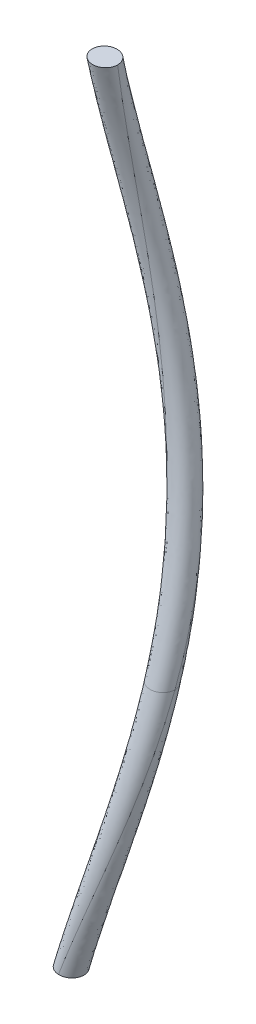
ISO-10303-21;
HEADER;
FILE_DESCRIPTION(('STEP AP214'),'2;1');
FILE_NAME('part.step','',(''),(''),'','','');
FILE_SCHEMA(('AUTOMOTIVE_DESIGN { 1 0 10303 214 1 1 1 1 }'));
ENDSEC;
DATA;
#1=APPLICATION_CONTEXT('core data for automotive mechanical design processes');
#2=APPLICATION_PROTOCOL_DEFINITION('international standard','automotive_design',2000,#1);
#3=PRODUCT_CONTEXT('',#1,'mechanical');
#4=PRODUCT('Part','Part','',(#3));
#5=PRODUCT_RELATED_PRODUCT_CATEGORY('part','',(#4));
#6=PRODUCT_DEFINITION_FORMATION('','',#4);
#7=PRODUCT_DEFINITION_CONTEXT('part definition',#1,'design');
#8=PRODUCT_DEFINITION('design','',#6,#7);
#9=PRODUCT_DEFINITION_SHAPE('','',#8);
#10=(LENGTH_UNIT() NAMED_UNIT(*) SI_UNIT(.MILLI.,.METRE.));
#11=(NAMED_UNIT(*) PLANE_ANGLE_UNIT() SI_UNIT($,.RADIAN.));
#12=(NAMED_UNIT(*) SI_UNIT($,.STERADIAN.) SOLID_ANGLE_UNIT());
#13=UNCERTAINTY_MEASURE_WITH_UNIT(LENGTH_MEASURE(1.E-05),#10,'distance_accuracy_value','');
#14=(GEOMETRIC_REPRESENTATION_CONTEXT(3) GLOBAL_UNCERTAINTY_ASSIGNED_CONTEXT((#13)) GLOBAL_UNIT_ASSIGNED_CONTEXT((#10,
#11,#12)) REPRESENTATION_CONTEXT('',''));
#15=CARTESIAN_POINT('',(0.,0.,0.));
#16=DIRECTION('',(0.,0.,1.));
#17=DIRECTION('',(1.,0.,0.));
#18=AXIS2_PLACEMENT_3D('',#15,#16,#17);
#19=CARTESIAN_POINT('',(-50.9866786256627,-23.4965384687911,-35.56104775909));
#20=DIRECTION('',(-0.0440198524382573,-0.999030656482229,0.));
#21=DIRECTION('',(0.999030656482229,-0.0440198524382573,0.));
#22=AXIS2_PLACEMENT_3D('',#19,#20,#21);
#23=PLANE('',#22);
#24=CARTESIAN_POINT('',(-50.9866786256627,-23.4965384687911,-34.49307437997));
#25=CARTESIAN_POINT('',(-50.9585774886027,-23.4977766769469,-34.4930982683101));
#26=CARTESIAN_POINT('',(-50.9304834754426,-23.4990145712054,-34.4907021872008));
#27=CARTESIAN_POINT('',(-50.8751101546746,-23.5014544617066,-34.4812461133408));
#28=CARTESIAN_POINT('',(-50.8478302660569,-23.5026564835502,-34.4741895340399));
#29=CARTESIAN_POINT('',(-50.7948299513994,-23.5049918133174,-34.4555837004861));
#30=CARTESIAN_POINT('',(-50.7691102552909,-23.5061250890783,-34.4440323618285));
#31=CARTESIAN_POINT('',(-50.7199779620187,-23.5082899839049,-34.4167752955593));
#32=CARTESIAN_POINT('',(-50.6965649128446,-23.5093216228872,-34.4010703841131));
#33=CARTESIAN_POINT('',(-50.6527183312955,-23.5112536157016,-34.3659595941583));
#34=CARTESIAN_POINT('',(-50.6322830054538,-23.5121540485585,-34.3465559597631));
#35=CARTESIAN_POINT('',(-50.5949277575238,-23.5138000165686,-34.3045623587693));
#36=CARTESIAN_POINT('',(-50.5780128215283,-23.5145453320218,-34.2819679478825));
#37=CARTESIAN_POINT('',(-50.5482386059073,-23.5158572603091,-34.2342926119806));
#38=CARTESIAN_POINT('',(-50.5353731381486,-23.5164241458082,-34.2092155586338));
#39=CARTESIAN_POINT('',(-50.5140091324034,-23.5173654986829,-34.157212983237));
#40=CARTESIAN_POINT('',(-50.5055179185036,-23.5177396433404,-34.130284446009));
#41=CARTESIAN_POINT('',(-50.4931765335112,-23.518283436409,-34.0753820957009));
#42=CARTESIAN_POINT('',(-50.4893263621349,-23.5184530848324,-34.0474082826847));
#43=CARTESIAN_POINT('',(-50.4863788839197,-23.5185829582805,-33.9912578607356));
#44=CARTESIAN_POINT('',(-50.487273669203,-23.5185435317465,-33.9630816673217));
#45=CARTESIAN_POINT('',(-50.4937774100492,-23.518256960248,-33.9072365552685));
#46=CARTESIAN_POINT('',(-50.4993934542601,-23.5180095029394,-33.8795684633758));
#47=CARTESIAN_POINT('',(-50.5151787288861,-23.5173139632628,-33.8256062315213));
#48=CARTESIAN_POINT('',(-50.5253418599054,-23.5168661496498,-33.7993103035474));
#49=CARTESIAN_POINT('',(-50.5499401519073,-23.5157822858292,-33.7487802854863));
#50=CARTESIAN_POINT('',(-50.5643782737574,-23.5151461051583,-33.7245476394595));
#51=CARTESIAN_POINT('',(-50.5971132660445,-23.5137037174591,-33.6788538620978));
#52=CARTESIAN_POINT('',(-50.6154099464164,-23.5128975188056,-33.6573925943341));
#53=CARTESIAN_POINT('',(-50.6553439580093,-23.511137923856,-33.6178482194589));
#54=CARTESIAN_POINT('',(-50.6769814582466,-23.5101845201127,-33.599765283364));
#55=CARTESIAN_POINT('',(-50.7229816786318,-23.5081576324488,-33.5674934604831));
#56=CARTESIAN_POINT('',(-50.7473442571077,-23.5070841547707,-33.5533043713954));
#57=CARTESIAN_POINT('',(-50.7981214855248,-23.5048467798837,-33.5292109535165));
#58=CARTESIAN_POINT('',(-50.824537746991,-23.5036828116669,-33.5193100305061));
#59=CARTESIAN_POINT('',(-50.8786231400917,-23.5012996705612,-33.5041071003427));
#60=CARTESIAN_POINT('',(-50.9062902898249,-23.5000805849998,-33.49879806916));
#61=CARTESIAN_POINT('',(-50.951629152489,-23.498082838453,-33.4939949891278));
#62=CARTESIAN_POINT('',(-50.9691584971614,-23.497310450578,-33.4930669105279));
#63=CARTESIAN_POINT('',(-50.9866786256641,-23.496538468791,-33.49307437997));
#64=B_SPLINE_CURVE_WITH_KNOTS('',3,(#24,#25,#26,#27,#28,#29,#30,#31,#32,#33,#34,#35,#36,#37,#38,
#39,#40,#41,#42,#43,#44,#45,#46,#47,#48,#49,#50,#51,#52,#53,#54,#55,#56,#57,#58,#59,#60,#61,#62,
#63),.UNSPECIFIED.,.F.,.F.,(4,2,2,2,2,2,2,2,2,2,2,2,2,2,2,2,2,2,2,4),(0.,0.0842731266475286,
0.168484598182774,0.252735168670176,0.336969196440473,0.421152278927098,0.505453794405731,
0.589625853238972,0.673938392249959,0.758250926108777,0.842422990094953,0.926721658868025,
1.0109075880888,1.09515196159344,1.17939218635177,1.26363667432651,1.34787678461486,
1.43218367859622,1.51636138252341,1.56897272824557),.UNSPECIFIED.);
#65=CARTESIAN_POINT('',(-50.9866786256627,-23.4965384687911,-34.49307437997));
#66=VERTEX_POINT('',#65);
#67=CARTESIAN_POINT('',(-50.9866786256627,-23.4965384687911,-33.49307437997));
#68=VERTEX_POINT('',#67);
#69=EDGE_CURVE('E21',#66,#68,#64,.T.);
#70=ORIENTED_EDGE('',*,*,#69,.T.);
#71=CARTESIAN_POINT('',(-50.9866786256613,-23.4965384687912,-33.49307437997));
#72=CARTESIAN_POINT('',(-51.0147797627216,-23.4953002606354,-33.4930504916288));
#73=CARTESIAN_POINT('',(-51.0428737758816,-23.4940623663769,-33.4954465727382));
#74=CARTESIAN_POINT('',(-51.0982470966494,-23.4916224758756,-33.5049026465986));
#75=CARTESIAN_POINT('',(-51.1255269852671,-23.4904204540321,-33.5119592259));
#76=CARTESIAN_POINT('',(-51.1785272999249,-23.4880851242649,-33.5305650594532));
#77=CARTESIAN_POINT('',(-51.204246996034,-23.4869518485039,-33.5421163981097));
#78=CARTESIAN_POINT('',(-51.2533792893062,-23.4847869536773,-33.5693734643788));
#79=CARTESIAN_POINT('',(-51.2767923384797,-23.483755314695,-33.585078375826));
#80=CARTESIAN_POINT('',(-51.3206389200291,-23.4818233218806,-33.6201891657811));
#81=CARTESIAN_POINT('',(-51.3410742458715,-23.4809228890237,-33.6395928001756));
#82=CARTESIAN_POINT('',(-51.3784294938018,-23.4792769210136,-33.6815864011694));
#83=CARTESIAN_POINT('',(-51.3953444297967,-23.4785316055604,-33.7041808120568));
#84=CARTESIAN_POINT('',(-51.4251186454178,-23.4772196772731,-33.751856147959));
#85=CARTESIAN_POINT('',(-51.4379841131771,-23.476652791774,-33.7769332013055));
#86=CARTESIAN_POINT('',(-51.4593481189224,-23.4757114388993,-33.8289357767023));
#87=CARTESIAN_POINT('',(-51.4678393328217,-23.4753372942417,-33.8558643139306));
#88=CARTESIAN_POINT('',(-51.480180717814,-23.4747935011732,-33.9107666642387));
#89=CARTESIAN_POINT('',(-51.4840308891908,-23.4746238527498,-33.9387404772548));
#90=CARTESIAN_POINT('',(-51.4869783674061,-23.4744939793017,-33.9948908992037));
#91=CARTESIAN_POINT('',(-51.4860835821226,-23.4745334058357,-34.0230670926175));
#92=CARTESIAN_POINT('',(-51.4795798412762,-23.4748199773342,-34.0789122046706));
#93=CARTESIAN_POINT('',(-51.4739637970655,-23.4750674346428,-34.1065802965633));
#94=CARTESIAN_POINT('',(-51.4581785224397,-23.4757629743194,-34.1605425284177));
#95=CARTESIAN_POINT('',(-51.4480153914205,-23.4762107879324,-34.1868384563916));
#96=CARTESIAN_POINT('',(-51.4234170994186,-23.4772946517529,-34.2373684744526));
#97=CARTESIAN_POINT('',(-51.4089789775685,-23.4779308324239,-34.2616011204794));
#98=CARTESIAN_POINT('',(-51.3762439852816,-23.4793732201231,-34.3072948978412));
#99=CARTESIAN_POINT('',(-51.35794730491,-23.4801794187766,-34.3287561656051));
#100=CARTESIAN_POINT('',(-51.318013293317,-23.4819390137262,-34.3683005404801));
#101=CARTESIAN_POINT('',(-51.2963757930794,-23.4828924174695,-34.3863834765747));
#102=CARTESIAN_POINT('',(-51.2503755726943,-23.4849193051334,-34.4186552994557));
#103=CARTESIAN_POINT('',(-51.2260129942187,-23.4859927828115,-34.4328443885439));
#104=CARTESIAN_POINT('',(-51.1752357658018,-23.4882301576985,-34.4569378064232));
#105=CARTESIAN_POINT('',(-51.1488195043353,-23.4893941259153,-34.4668387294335));
#106=CARTESIAN_POINT('',(-51.0947341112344,-23.491777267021,-34.482041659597));
#107=CARTESIAN_POINT('',(-51.0670669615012,-23.4929963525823,-34.4873506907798));
#108=CARTESIAN_POINT('',(-51.0217280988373,-23.4949940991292,-34.4921537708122));
#109=CARTESIAN_POINT('',(-51.0041987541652,-23.4957664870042,-34.4930818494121));
#110=CARTESIAN_POINT('',(-50.9866786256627,-23.4965384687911,-34.49307437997));
#111=B_SPLINE_CURVE_WITH_KNOTS('',3,(#71,#72,#73,#74,#75,#76,#77,#78,#79,#80,#81,#82,#83,#84,
#85,#86,#87,#88,#89,#90,#91,#92,#93,#94,#95,#96,#97,#98,#99,#100,#101,#102,#103,#104,#105,#106,
#107,#108,#109,#110),.UNSPECIFIED.,.F.,.F.,(4,2,2,2,2,2,2,2,2,2,2,2,2,2,2,2,2,2,2,4),(0.,
0.084273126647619,0.16848459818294,0.252735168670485,0.336969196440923,0.421152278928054,
0.505453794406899,0.589625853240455,0.673938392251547,0.758250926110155,0.842422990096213,
0.926721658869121,1.01090758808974,1.09515196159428,1.17939218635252,1.26363667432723,
1.34787678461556,1.43218367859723,1.51636138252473,1.5689727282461),.UNSPECIFIED.);
#112=EDGE_CURVE('E58',#68,#66,#111,.T.);
#113=ORIENTED_EDGE('',*,*,#112,.T.);
#114=EDGE_LOOP('',(#70,#113));
#115=FACE_BOUND('',#114,.T.);
#116=ADVANCED_FACE('F17',(#115),#23,.T.);
#117=CARTESIAN_POINT('',(-49.4795419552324,-13.5532439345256,-35.56104775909));
#118=CARTESIAN_POINT('',(-49.4795419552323,-13.5532439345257,-35.8943810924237));
#119=CARTESIAN_POINT('',(-49.2297842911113,-13.5642488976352,-36.1860477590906));
#120=CARTESIAN_POINT('',(-48.8135215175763,-13.5825905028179,-36.2277144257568));
#121=CARTESIAN_POINT('',(-48.480511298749,-13.5972637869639,-35.9610477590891));
#122=CARTESIAN_POINT('',(-48.4805112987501,-13.5972637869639,-35.5610477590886));
#123=CARTESIAN_POINT('',(-49.5676983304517,-15.5539530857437,-35.225089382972));
#124=CARTESIAN_POINT('',(-49.4629414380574,-15.5585689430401,-35.558422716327));
#125=CARTESIAN_POINT('',(-49.1215214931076,-15.5736127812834,-35.7714454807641));
#126=CARTESIAN_POINT('',(-48.6921641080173,-15.5925313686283,-35.6820389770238));
#127=CARTESIAN_POINT('',(-48.4429594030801,-15.6035119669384,-35.3105137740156));
#128=CARTESIAN_POINT('',(-48.5686676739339,-15.5979729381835,-34.9105137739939));
#129=CARTESIAN_POINT('',(-49.7878319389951,-17.5488460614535,-34.889131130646));
#130=CARTESIAN_POINT('',(-49.578318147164,-17.5580777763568,-35.1812320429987));
#131=CARTESIAN_POINT('',(-49.1761302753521,-17.5757992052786,-35.2795325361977));
#132=CARTESIAN_POINT('',(-48.7851688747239,-17.5930259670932,-35.0538988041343));
#133=CARTESIAN_POINT('',(-48.6609621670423,-17.5984988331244,-34.610500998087));
#134=CARTESIAN_POINT('',(-48.9123787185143,-17.5874207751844,-34.2599799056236));
#135=CARTESIAN_POINT('',(-50.139099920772,-19.5246946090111,-34.625179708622));
#136=CARTESIAN_POINT('',(-49.8472821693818,-19.5375528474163,-34.8348968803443));
#137=CARTESIAN_POINT('',(-49.4348061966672,-19.5557275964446,-34.7993237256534));
#138=CARTESIAN_POINT('',(-49.1364365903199,-19.5688745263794,-34.4604122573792));
#139=CARTESIAN_POINT('',(-49.1603768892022,-19.567819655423,-34.0005376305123));
#140=CARTESIAN_POINT('',(-49.5105581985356,-19.552389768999,-33.7488770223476));
#141=CARTESIAN_POINT('',(-50.5628895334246,-21.5106181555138,-34.49307437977));
#142=CARTESIAN_POINT('',(-50.2298793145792,-21.5252914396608,-34.5979329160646));
#143=CARTESIAN_POINT('',(-49.8599277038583,-21.5415924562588,-34.4396841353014));
#144=CARTESIAN_POINT('',(-49.6873553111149,-21.549196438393,-34.0361247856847));
#145=CARTESIAN_POINT('',(-49.8490065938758,-21.5420736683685,-33.6189046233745));
#146=CARTESIAN_POINT('',(-50.2486188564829,-21.5244657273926,-33.4930743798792));
#147=CARTESIAN_POINT('',(-50.9866786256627,-23.4965384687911,-34.49307437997));
#148=CARTESIAN_POINT('',(-50.6536684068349,-23.5112117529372,-34.49307437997));
#149=CARTESIAN_POINT('',(-50.3622844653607,-23.524050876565,-34.2430743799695));
#150=CARTESIAN_POINT('',(-50.3206581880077,-23.5258850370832,-33.8264077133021));
#151=CARTESIAN_POINT('',(-50.5870663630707,-23.5141464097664,-33.4930743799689));
#152=CARTESIAN_POINT('',(-50.9866786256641,-23.496538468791,-33.49307437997));
#153=(BOUNDED_SURFACE() B_SPLINE_SURFACE(5,5,((#117,#118,#119,#120,#121,#122),(#123,#124,#125,
#126,#127,#128),(#129,#130,#131,#132,#133,#134),(#135,#136,#137,#138,#139,#140),(#141,#142,#143,
#144,#145,#146),(#147,#148,#149,#150,#151,#152)),.UNSPECIFIED.,.F.,.F.,
.F.) B_SPLINE_SURFACE_WITH_KNOTS((6,6),(6,6),(0.,10.6785562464),(0.,1.5707963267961),
.UNSPECIFIED.) GEOMETRIC_REPRESENTATION_ITEM() RATIONAL_B_SPLINE_SURFACE(((1.,0.599999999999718,
0.399999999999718,0.299999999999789,0.249999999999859,0.25),(1.,0.599999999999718,
0.399999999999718,0.299999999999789,0.249999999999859,0.25),(1.,0.599999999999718,
0.399999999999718,0.299999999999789,0.249999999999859,0.25),(1.,0.599999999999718,
0.399999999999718,0.299999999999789,0.249999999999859,0.25),(1.,0.599999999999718,
0.399999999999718,0.299999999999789,0.249999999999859,0.25),(1.,0.599999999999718,
0.399999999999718,0.299999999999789,0.249999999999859,0.25))) REPRESENTATION_ITEM('') SURFACE());
#154=CARTESIAN_POINT('',(-48.9800266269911,-13.5752538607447,-35.5610477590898));
#155=DIRECTION('',(0.0440198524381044,0.999030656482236,0.));
#156=DIRECTION('',(-0.999030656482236,0.0440198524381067,-4.02455846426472E-13));
#157=AXIS2_PLACEMENT_3D('',#154,#155,#156);
#158=CIRCLE('',#157,0.500000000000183);
#159=CARTESIAN_POINT('',(-48.48051129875,-13.5972637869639,-35.5610477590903));
#160=VERTEX_POINT('',#159);
#161=CARTESIAN_POINT('',(-49.4795419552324,-13.5532439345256,-35.56104775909));
#162=VERTEX_POINT('',#161);
#163=EDGE_CURVE('E65',#160,#162,#158,.T.);
#164=CARTESIAN_POINT('',(-48.4805112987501,-13.5972637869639,-35.5610477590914));
#165=CARTESIAN_POINT('',(-48.568667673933,-15.5979729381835,-34.9105137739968));
#166=CARTESIAN_POINT('',(-48.9123787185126,-17.5874207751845,-34.2599799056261));
#167=CARTESIAN_POINT('',(-49.5105581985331,-19.5523897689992,-33.7488770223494));
#168=CARTESIAN_POINT('',(-50.2486188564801,-21.5244657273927,-33.4930743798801));
#169=CARTESIAN_POINT('',(-50.9866786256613,-23.4965384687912,-33.49307437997));
#170=B_SPLINE_CURVE_WITH_KNOTS('',5,(#164,#165,#166,#167,#168,#169),.UNSPECIFIED.,.F.,.F.,(6,6),
(0.,10.6785562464),.UNSPECIFIED.);
#171=EDGE_CURVE('E61',#160,#68,#170,.T.);
#172=CARTESIAN_POINT('',(-49.4795419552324,-13.5532439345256,-35.56104775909));
#173=CARTESIAN_POINT('',(-49.5676983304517,-15.5539530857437,-35.225089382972));
#174=CARTESIAN_POINT('',(-49.7878319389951,-17.5488460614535,-34.889131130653));
#175=CARTESIAN_POINT('',(-50.139099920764,-19.5246946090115,-34.625179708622));
#176=CARTESIAN_POINT('',(-50.5628895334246,-21.5106181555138,-34.49307437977));
#177=CARTESIAN_POINT('',(-50.9866786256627,-23.4965384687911,-34.49307437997));
#178=B_SPLINE_CURVE_WITH_KNOTS('',5,(#172,#173,#174,#175,#176,#177),.UNSPECIFIED.,.F.,.F.,(6,6),
(0.,10.6785562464),.UNSPECIFIED.);
#179=EDGE_CURVE('E63',#66,#162,#178,.F.);
#180=ORIENTED_EDGE('',*,*,#163,.F.);
#181=ORIENTED_EDGE('',*,*,#171,.T.);
#182=ORIENTED_EDGE('',*,*,#69,.F.);
#183=ORIENTED_EDGE('',*,*,#179,.T.);
#184=EDGE_LOOP('',(#180,#181,#182,#183));
#185=FACE_BOUND('',#184,.T.);
#186=ADVANCED_FACE('F66',(#185),#153,.F.);
#187=CARTESIAN_POINT('',(-48.4805112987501,-13.5972637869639,-35.5610477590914));
#188=CARTESIAN_POINT('',(-48.480511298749,-13.5972637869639,-35.1610477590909));
#189=CARTESIAN_POINT('',(-48.8135215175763,-13.5825905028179,-34.8943810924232));
#190=CARTESIAN_POINT('',(-49.2297842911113,-13.5642488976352,-34.9360477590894));
#191=CARTESIAN_POINT('',(-49.4795419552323,-13.5532439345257,-35.2277144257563));
#192=CARTESIAN_POINT('',(-49.4795419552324,-13.5532439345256,-35.56104775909));
#193=CARTESIAN_POINT('',(-48.568667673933,-15.5979729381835,-34.9105137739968));
#194=CARTESIAN_POINT('',(-48.6943759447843,-15.5924339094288,-34.5105137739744));
#195=CARTESIAN_POINT('',(-49.1111916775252,-15.5740679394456,-34.3487056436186));
#196=CARTESIAN_POINT('',(-49.514359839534,-15.556303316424,-34.5214454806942));
#197=CARTESIAN_POINT('',(-49.6724552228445,-15.5493372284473,-34.8917560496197));
#198=CARTESIAN_POINT('',(-49.5676983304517,-15.5539530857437,-35.225089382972));
#199=CARTESIAN_POINT('',(-48.9123787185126,-17.5874207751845,-34.2599799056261));
#200=CARTESIAN_POINT('',(-49.1637952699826,-17.5763427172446,-33.9094588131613));
#201=CARTESIAN_POINT('',(-49.6232240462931,-17.5560991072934,-33.8854951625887));
#202=CARTESIAN_POINT('',(-49.9618070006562,-17.54118027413,-34.1841541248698));
#203=CARTESIAN_POINT('',(-49.9973457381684,-17.5396143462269,-34.5970302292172));
#204=CARTESIAN_POINT('',(-49.7878319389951,-17.5488460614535,-34.889131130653));
#205=CARTESIAN_POINT('',(-49.5105581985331,-19.5523897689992,-33.7488770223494));
#206=CARTESIAN_POINT('',(-49.8607395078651,-19.5369598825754,-33.4972164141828));
#207=CARTESIAN_POINT('',(-50.3037076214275,-19.5174415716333,-33.6215435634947));
#208=CARTESIAN_POINT('',(-50.5291227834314,-19.507509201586,-34.0128843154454));
#209=CARTESIAN_POINT('',(-50.4309176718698,-19.5118363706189,-34.4154625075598));
#210=CARTESIAN_POINT('',(-50.139099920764,-19.5246946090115,-34.625179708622));
#211=CARTESIAN_POINT('',(-50.2486188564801,-21.5244657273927,-33.4930743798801));
#212=CARTESIAN_POINT('',(-50.6482311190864,-21.5068577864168,-33.3672441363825));
#213=CARTESIAN_POINT('',(-51.0193961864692,-21.4905033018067,-33.6166906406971));
#214=CARTESIAN_POINT('',(-51.1087160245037,-21.486567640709,-34.046464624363));
#215=CARTESIAN_POINT('',(-50.8958997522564,-21.4959448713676,-34.3882158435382));
#216=CARTESIAN_POINT('',(-50.5628895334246,-21.5106181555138,-34.49307437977));
#217=CARTESIAN_POINT('',(-50.9866786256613,-23.4965384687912,-33.49307437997));
#218=CARTESIAN_POINT('',(-51.3862908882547,-23.4789305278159,-33.4930743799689));
#219=CARTESIAN_POINT('',(-51.6526990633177,-23.4671919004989,-33.8264077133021));
#220=CARTESIAN_POINT('',(-51.6110727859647,-23.4690260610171,-34.2430743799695));
#221=CARTESIAN_POINT('',(-51.3196888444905,-23.481865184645,-34.49307437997));
#222=CARTESIAN_POINT('',(-50.9866786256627,-23.4965384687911,-34.49307437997));
#223=(BOUNDED_SURFACE() B_SPLINE_SURFACE(5,5,((#187,#188,#189,#190,#191,#192),(#193,#194,#195,
#196,#197,#198),(#199,#200,#201,#202,#203,#204),(#205,#206,#207,#208,#209,#210),(#211,#212,#213,
#214,#215,#216),(#217,#218,#219,#220,#221,#222)),.UNSPECIFIED.,.F.,.F.,
.F.) B_SPLINE_SURFACE_WITH_KNOTS((6,6),(6,6),(0.,10.6785562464),(1.57079632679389,
3.14159265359),.UNSPECIFIED.) GEOMETRIC_REPRESENTATION_ITEM() RATIONAL_B_SPLINE_SURFACE(((0.25,
0.249999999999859,0.299999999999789,0.399999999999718,0.599999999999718,1.),(0.25,
0.249999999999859,0.299999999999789,0.399999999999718,0.599999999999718,1.),(0.25,
0.249999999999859,0.299999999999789,0.399999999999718,0.599999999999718,1.),(0.25,
0.249999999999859,0.299999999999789,0.399999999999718,0.599999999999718,1.),(0.25,
0.249999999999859,0.299999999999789,0.399999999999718,0.599999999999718,1.),(0.25,
0.249999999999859,0.299999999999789,0.399999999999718,0.599999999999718,1.))) REPRESENTATION_ITEM('') SURFACE());
#224=CARTESIAN_POINT('',(-48.9800266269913,-13.5752538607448,-35.5610477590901));
#225=DIRECTION('',(-0.0440198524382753,-0.999030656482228,0.));
#226=DIRECTION('',(0.999030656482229,-0.0440198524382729,-2.62290189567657E-12));
#227=AXIS2_PLACEMENT_3D('',#224,#225,#226);
#228=CIRCLE('',#227,0.500000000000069);
#229=EDGE_CURVE('E69',#160,#162,#228,.T.);
#230=ORIENTED_EDGE('',*,*,#229,.T.);
#231=ORIENTED_EDGE('',*,*,#179,.F.);
#232=ORIENTED_EDGE('',*,*,#112,.F.);
#233=ORIENTED_EDGE('',*,*,#171,.F.);
#234=EDGE_LOOP('',(#230,#231,#232,#233));
#235=FACE_BOUND('',#234,.T.);
#236=ADVANCED_FACE('F60',(#235),#223,.F.);
#237=CARTESIAN_POINT('',(-49.666083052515,6.47438122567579,-35.56104775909));
#238=DIRECTION('',(-0.0440198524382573,-0.999030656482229,0.));
#239=DIRECTION('',(0.999030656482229,-0.0440198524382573,0.));
#240=AXIS2_PLACEMENT_3D('',#237,#238,#239);
#241=PLANE('',#240);
#242=CARTESIAN_POINT('',(-51.732051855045,6.5654131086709,-35.5610477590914));
#243=CARTESIAN_POINT('',(-51.7320757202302,6.56541416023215,-35.5329193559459));
#244=CARTESIAN_POINT('',(-51.7296819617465,6.56530868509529,-35.5047980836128));
#245=CARTESIAN_POINT('',(-51.72023505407,6.56489243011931,-35.4493710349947));
#246=CARTESIAN_POINT('',(-51.7131853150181,6.56458180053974,-35.4220646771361));
#247=CARTESIAN_POINT('',(-51.694597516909,6.56376277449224,-35.3690129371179));
#248=CARTESIAN_POINT('',(-51.6830573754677,6.56325428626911,-35.3432682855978));
#249=CARTESIAN_POINT('',(-51.6558267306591,6.56205443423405,-35.2940883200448));
#250=CARTESIAN_POINT('',(-51.6401370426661,6.56136310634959,-35.270652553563));
#251=CARTESIAN_POINT('',(-51.6050602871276,6.55981753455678,-35.2267634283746));
#252=CARTESIAN_POINT('',(-51.5856754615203,6.55896338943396,-35.2063082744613));
#253=CARTESIAN_POINT('',(-51.5437225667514,6.55711483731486,-35.1689167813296));
#254=CARTESIAN_POINT('',(-51.5211500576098,6.55612023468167,-35.1519854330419));
#255=CARTESIAN_POINT('',(-51.4735209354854,6.55402157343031,-35.1221823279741));
#256=CARTESIAN_POINT('',(-51.448468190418,6.55291768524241,-35.1093043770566));
#257=CARTESIAN_POINT('',(-51.3965160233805,6.55062853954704,-35.0879196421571));
#258=CARTESIAN_POINT('',(-51.3696135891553,6.54944314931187,-35.0794201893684));
#259=CARTESIAN_POINT('',(-51.3147644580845,6.54702635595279,-35.0670668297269));
#260=CARTESIAN_POINT('',(-51.2868177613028,6.54579495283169,-35.0632129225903));
#261=CARTESIAN_POINT('',(-51.2307217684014,6.54332321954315,-35.0602625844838));
#262=CARTESIAN_POINT('',(-51.202572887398,6.54208290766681,-35.0611582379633));
#263=CARTESIAN_POINT('',(-51.1467819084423,6.53962461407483,-35.0676682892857));
#264=CARTESIAN_POINT('',(-51.1191406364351,6.53840666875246,-35.0732897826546));
#265=CARTESIAN_POINT('',(-51.0652307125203,6.53603125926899,-35.0890903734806));
#266=CARTESIAN_POINT('',(-51.0389602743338,6.53487371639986,-35.0992633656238));
#267=CARTESIAN_POINT('',(-50.9884792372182,6.53264939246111,-35.1238855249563));
#268=CARTESIAN_POINT('',(-50.9642700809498,6.53158267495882,-35.1383376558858));
#269=CARTESIAN_POINT('',(-50.9186205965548,6.529571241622,-35.1711044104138));
#270=CARTESIAN_POINT('',(-50.8971801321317,6.5286265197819,-35.1894188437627));
#271=CARTESIAN_POINT('',(-50.8576740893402,6.52688578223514,-35.2293916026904));
#272=CARTESIAN_POINT('',(-50.8396086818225,6.5260897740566,-35.2510500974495));
#273=CARTESIAN_POINT('',(-50.8073681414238,6.52466917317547,-35.297094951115));
#274=CARTESIAN_POINT('',(-50.7931928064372,6.52404457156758,-35.321481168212));
#275=CARTESIAN_POINT('',(-50.7691227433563,6.5229839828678,-35.3723076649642));
#276=CARTESIAN_POINT('',(-50.7592314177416,6.52254814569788,-35.3987495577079));
#277=CARTESIAN_POINT('',(-50.7440432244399,6.52187891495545,-35.4528874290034));
#278=CARTESIAN_POINT('',(-50.738739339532,6.52164521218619,-35.4805814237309));
#279=CARTESIAN_POINT('',(-50.7339409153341,6.52143378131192,-35.5259642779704));
#280=CARTESIAN_POINT('',(-50.7330137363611,6.5213929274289,-35.5435106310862));
#281=CARTESIAN_POINT('',(-50.7330211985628,6.52139325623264,-35.56104775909));
#282=B_SPLINE_CURVE_WITH_KNOTS('',3,(#242,#243,#244,#245,#246,#247,#248,#249,#250,#251,#252,
#253,#254,#255,#256,#257,#258,#259,#260,#261,#262,#263,#264,#265,#266,#267,#268,#269,#270,#271,
#272,#273,#274,#275,#276,#277,#278,#279,#280,#281),.UNSPECIFIED.,.F.,.F.,(4,2,2,2,2,2,2,2,2,2,2,
2,2,2,2,2,2,2,2,4),(0.,0.0842731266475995,0.168484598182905,0.252735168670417,0.336969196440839,
0.421152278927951,0.505453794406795,0.589625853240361,0.673938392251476,0.758250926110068,
0.84242299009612,0.926721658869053,1.0109075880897,1.09515196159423,1.17939218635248,
1.26363667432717,1.34787678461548,1.43218367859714,1.51636138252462,1.56897272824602),.UNSPECIFIED.);
#283=CARTESIAN_POINT('',(-51.732051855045,6.5654131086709,-35.56104775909));
#284=VERTEX_POINT('',#283);
#285=CARTESIAN_POINT('',(-50.7330211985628,6.52139325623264,-35.56104775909));
#286=VERTEX_POINT('',#285);
#287=EDGE_CURVE('E39',#284,#286,#282,.T.);
#288=ORIENTED_EDGE('',*,*,#287,.T.);
#289=CARTESIAN_POINT('',(-50.7330211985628,6.52139325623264,-35.56104775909));
#290=CARTESIAN_POINT('',(-50.7329973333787,6.52139220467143,-35.5891761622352));
#291=CARTESIAN_POINT('',(-50.7353910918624,6.5214976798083,-35.6172974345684));
#292=CARTESIAN_POINT('',(-50.7448379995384,6.52191393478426,-35.6727244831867));
#293=CARTESIAN_POINT('',(-50.7518877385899,6.5222245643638,-35.7000308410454));
#294=CARTESIAN_POINT('',(-50.7704755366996,6.52304359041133,-35.7530825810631));
#295=CARTESIAN_POINT('',(-50.7820156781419,6.5235520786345,-35.7788272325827));
#296=CARTESIAN_POINT('',(-50.8092463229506,6.52475193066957,-35.8280071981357));
#297=CARTESIAN_POINT('',(-50.8249360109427,6.52544325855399,-35.8514429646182));
#298=CARTESIAN_POINT('',(-50.8600127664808,6.52698883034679,-35.8953320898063));
#299=CARTESIAN_POINT('',(-50.8793975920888,6.52784297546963,-35.9157872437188));
#300=CARTESIAN_POINT('',(-50.9213504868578,6.52969152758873,-35.9531787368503));
#301=CARTESIAN_POINT('',(-50.9439229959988,6.5306861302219,-35.9701100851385));
#302=CARTESIAN_POINT('',(-50.9915521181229,6.53278479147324,-35.9999131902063));
#303=CARTESIAN_POINT('',(-51.0166048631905,6.53388867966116,-36.0127911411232));
#304=CARTESIAN_POINT('',(-51.068557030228,6.53617782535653,-36.0341758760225));
#305=CARTESIAN_POINT('',(-51.0954594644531,6.53736321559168,-36.0426753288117));
#306=CARTESIAN_POINT('',(-51.1503085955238,6.53978000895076,-36.0550286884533));
#307=CARTESIAN_POINT('',(-51.1782552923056,6.54101141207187,-36.0588825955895));
#308=CARTESIAN_POINT('',(-51.2343512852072,6.54348314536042,-36.0618329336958));
#309=CARTESIAN_POINT('',(-51.2625001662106,6.54472345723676,-36.0609372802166));
#310=CARTESIAN_POINT('',(-51.3182911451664,6.54718175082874,-36.0544272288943));
#311=CARTESIAN_POINT('',(-51.3459324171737,6.54839969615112,-36.0488057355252));
#312=CARTESIAN_POINT('',(-51.3998423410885,6.55077510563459,-36.033005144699));
#313=CARTESIAN_POINT('',(-51.4261127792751,6.55193264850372,-36.0228321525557));
#314=CARTESIAN_POINT('',(-51.4765938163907,6.55415697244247,-35.9982099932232));
#315=CARTESIAN_POINT('',(-51.5008029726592,6.55522368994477,-35.9837578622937));
#316=CARTESIAN_POINT('',(-51.546452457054,6.55723512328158,-35.9509911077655));
#317=CARTESIAN_POINT('',(-51.5678929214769,6.55817984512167,-35.9326766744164));
#318=CARTESIAN_POINT('',(-51.6073989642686,6.55992058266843,-35.8927039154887));
#319=CARTESIAN_POINT('',(-51.6254643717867,6.56071659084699,-35.8710454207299));
#320=CARTESIAN_POINT('',(-51.6577049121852,6.56213719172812,-35.8250005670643));
#321=CARTESIAN_POINT('',(-51.6718802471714,6.56276179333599,-35.800614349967));
#322=CARTESIAN_POINT('',(-51.6959503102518,6.56382238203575,-35.7497878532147));
#323=CARTESIAN_POINT('',(-51.7058416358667,6.56425821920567,-35.7233459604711));
#324=CARTESIAN_POINT('',(-51.7210298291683,6.5649274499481,-35.6692080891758));
#325=CARTESIAN_POINT('',(-51.726333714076,6.56516115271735,-35.6415140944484));
#326=CARTESIAN_POINT('',(-51.7311321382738,6.56537258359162,-35.5961312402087));
#327=CARTESIAN_POINT('',(-51.7320593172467,6.56541343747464,-35.5785848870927));
#328=CARTESIAN_POINT('',(-51.732051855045,6.5654131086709,-35.5610477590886));
#329=B_SPLINE_CURVE_WITH_KNOTS('',3,(#289,#290,#291,#292,#293,#294,#295,#296,#297,#298,#299,
#300,#301,#302,#303,#304,#305,#306,#307,#308,#309,#310,#311,#312,#313,#314,#315,#316,#317,#318,
#319,#320,#321,#322,#323,#324,#325,#326,#327,#328),.UNSPECIFIED.,.F.,.F.,(4,2,2,2,2,2,2,2,2,2,2,
2,2,2,2,2,2,2,2,4),(0.,0.0842731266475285,0.168484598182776,0.25273516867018,0.336969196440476,
0.421152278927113,0.505453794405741,0.589625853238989,0.673938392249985,0.75825092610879,
0.842422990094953,0.926721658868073,1.01090758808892,1.09515196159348,1.17939218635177,
1.2636366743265,1.34787678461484,1.43218367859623,1.51636138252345,1.56897272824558),.UNSPECIFIED.);
#330=EDGE_CURVE('E31',#286,#284,#329,.T.);
#331=ORIENTED_EDGE('',*,*,#330,.T.);
#332=EDGE_LOOP('',(#288,#331));
#333=FACE_BOUND('',#332,.T.);
#334=ADVANCED_FACE('F100',(#333),#241,.F.);
#335=CARTESIAN_POINT('',(-50.7330211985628,6.52139325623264,-35.56104775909));
#336=CARTESIAN_POINT('',(-50.7330211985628,6.52139325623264,-35.2277144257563));
#337=CARTESIAN_POINT('',(-50.9827788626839,6.53239821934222,-34.9360477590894));
#338=CARTESIAN_POINT('',(-51.3990416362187,6.55073982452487,-34.8943810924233));
#339=CARTESIAN_POINT('',(-51.7320518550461,6.56541310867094,-35.1610477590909));
#340=CARTESIAN_POINT('',(-51.732051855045,6.5654131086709,-35.5610477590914));
#341=CARTESIAN_POINT('',(-50.8508795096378,3.84659860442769,-36.010198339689));
#342=CARTESIAN_POINT('',(-50.990931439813,3.85276965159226,-35.6768650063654));
#343=CARTESIAN_POINT('',(-51.3632345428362,3.8691742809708,-35.4903392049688));
#344=CARTESIAN_POINT('',(-51.7970038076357,3.88828726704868,-35.6239073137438));
#345=CARTESIAN_POINT('',(-52.0179724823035,3.89802371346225,-36.0307618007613));
#346=CARTESIAN_POINT('',(-51.8499101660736,3.8906184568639,-36.4307618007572));
#347=CARTESIAN_POINT('',(-50.7328463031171,1.16140996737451,-36.459348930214));
#348=CARTESIAN_POINT('',(-51.0129501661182,1.17375206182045,-36.1997129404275));
#349=CARTESIAN_POINT('',(-51.4525792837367,1.19312324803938,-36.1828131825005));
#350=CARTESIAN_POINT('',(-51.8118226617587,1.20895243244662,-36.5008282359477));
#351=CARTESIAN_POINT('',(-51.8471238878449,1.21050789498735,-36.9889126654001));
#352=CARTESIAN_POINT('',(-51.5109992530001,1.19569738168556,-37.3004758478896));
#353=CARTESIAN_POINT('',(-50.3789719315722,-1.4805018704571,-36.73060414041));
#354=CARTESIAN_POINT('',(-50.7436572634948,-1.46443289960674,-36.617609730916));
#355=CARTESIAN_POINT('',(-51.1474205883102,-1.44664205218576,-36.7925190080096));
#356=CARTESIAN_POINT('',(-51.3341123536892,-1.43841593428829,-37.234693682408));
#357=CARTESIAN_POINT('',(-51.1552489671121,-1.44629711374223,-37.690128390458));
#358=CARTESIAN_POINT('',(-50.717626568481,-1.46557987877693,-37.8257216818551));
#359=CARTESIAN_POINT('',(-49.7966684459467,-5.52113726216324,-36.70050810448));
#360=CARTESIAN_POINT('',(-50.151969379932,-5.50548179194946,-36.8246005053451));
#361=CARTESIAN_POINT('',(-50.369878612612,-5.49588015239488,-37.199915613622));
#362=CARTESIAN_POINT('',(-50.2593260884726,-5.50075138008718,-37.6599842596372));
#363=CARTESIAN_POINT('',(-49.8511132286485,-5.51873828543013,-37.9163560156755));
#364=CARTESIAN_POINT('',(-49.4247521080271,-5.53752484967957,-37.7674451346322));
#365=CARTESIAN_POINT('',(-49.4790826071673,-9.55010849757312,-36.211462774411));
#366=CARTESIAN_POINT('',(-49.6818918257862,-9.54117220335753,-36.4899387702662));
#367=CARTESIAN_POINT('',(-49.6506953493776,-9.54254680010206,-36.885859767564));
#368=CARTESIAN_POINT('',(-49.3282889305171,-9.55675285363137,-37.1744267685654));
#369=CARTESIAN_POINT('',(-48.8878354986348,-9.57616036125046,-37.1546519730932));
#370=CARTESIAN_POINT('',(-48.6444644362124,-9.58688391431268,-36.8204807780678));
#371=CARTESIAN_POINT('',(-49.4206570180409,-10.8858589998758,-36.008521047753));
#372=CARTESIAN_POINT('',(-49.5601859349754,-10.8797109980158,-36.3235673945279));
#373=CARTESIAN_POINT('',(-49.4462180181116,-10.8847327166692,-36.7039811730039));
#374=CARTESIAN_POINT('',(-49.0702329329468,-10.9012995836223,-36.9179423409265));
#375=CARTESIAN_POINT('',(-48.6438688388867,-10.9200862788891,-36.8055695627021));
#376=CARTESIAN_POINT('',(-48.4764341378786,-10.9274638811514,-36.4275139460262));
#377=CARTESIAN_POINT('',(-49.4208328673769,-12.2208410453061,-35.78478438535));
#378=CARTESIAN_POINT('',(-49.4905973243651,-12.2177670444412,-36.1181177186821));
#379=CARTESIAN_POINT('',(-49.3018835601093,-12.226082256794,-36.4621584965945));
#380=CARTESIAN_POINT('',(-48.8943413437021,-12.2440396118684,-36.5911153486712));
#381=CARTESIAN_POINT('',(-48.5055195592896,-12.2611720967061,-36.3942808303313));
#382=CARTESIAN_POINT('',(-48.4218022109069,-12.2648608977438,-35.9942808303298));
#383=CARTESIAN_POINT('',(-49.4795419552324,-13.5532439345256,-35.56104775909));
#384=CARTESIAN_POINT('',(-49.4795419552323,-13.5532439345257,-35.8943810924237));
#385=CARTESIAN_POINT('',(-49.2297842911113,-13.5642488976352,-36.1860477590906));
#386=CARTESIAN_POINT('',(-48.8135215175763,-13.5825905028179,-36.2277144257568));
#387=CARTESIAN_POINT('',(-48.480511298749,-13.5972637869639,-35.9610477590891));
#388=CARTESIAN_POINT('',(-48.4805112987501,-13.5972637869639,-35.5610477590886));
#389=(BOUNDED_SURFACE() B_SPLINE_SURFACE(5,5,((#335,#336,#337,#338,#339,#340),(#341,#342,#343,
#344,#345,#346),(#347,#348,#349,#350,#351,#352),(#353,#354,#355,#356,#357,#358),(#359,#360,#361,
#362,#363,#364),(#365,#366,#367,#368,#369,#370),(#371,#372,#373,#374,#375,#376),(#377,#378,#379,
#380,#381,#382),(#383,#384,#385,#386,#387,#388)),.UNSPECIFIED.,.F.,.F.,
.F.) B_SPLINE_SURFACE_WITH_KNOTS((6,3,6),(6,6),(0.,14.2764105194,21.3879585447),(0.,
1.5707963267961),.UNSPECIFIED.) GEOMETRIC_REPRESENTATION_ITEM() RATIONAL_B_SPLINE_SURFACE(((1.,
0.599999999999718,0.399999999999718,0.299999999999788,0.249999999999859,0.25),(1.,
0.599999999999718,0.399999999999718,0.299999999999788,0.249999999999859,0.25),(1.,
0.599999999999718,0.399999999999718,0.299999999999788,0.249999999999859,0.25),(1.,
0.599999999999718,0.399999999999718,0.299999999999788,0.249999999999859,0.25),(1.,
0.599999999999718,0.399999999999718,0.299999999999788,0.249999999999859,0.25),(1.,
0.599999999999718,0.399999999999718,0.299999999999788,0.249999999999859,0.25),(1.,
0.599999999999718,0.399999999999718,0.299999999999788,0.249999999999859,0.25),(1.,
0.599999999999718,0.399999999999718,0.299999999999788,0.249999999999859,0.25),(1.,
0.599999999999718,0.399999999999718,0.299999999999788,0.249999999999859,0.25))) REPRESENTATION_ITEM('') SURFACE());
#390=CARTESIAN_POINT('',(-51.732051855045,6.5654131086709,-35.5610477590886));
#391=CARTESIAN_POINT('',(-51.8499101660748,3.89061845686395,-36.4307618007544));
#392=CARTESIAN_POINT('',(-51.5109992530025,1.19569738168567,-37.3004758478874));
#393=CARTESIAN_POINT('',(-50.717626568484,-1.4655798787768,-37.8257216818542));
#394=CARTESIAN_POINT('',(-49.4247521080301,-5.53752484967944,-37.7674451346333));
#395=CARTESIAN_POINT('',(-48.6444644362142,-9.5868839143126,-36.8204807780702));
#396=CARTESIAN_POINT('',(-48.4764341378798,-10.9274638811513,-36.4275139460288));
#397=CARTESIAN_POINT('',(-48.4218022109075,-12.2648608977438,-35.9942808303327));
#398=CARTESIAN_POINT('',(-48.4805112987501,-13.5972637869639,-35.5610477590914));
#399=B_SPLINE_CURVE_WITH_KNOTS('',5,(#390,#391,#392,#393,#394,#395,#396,#397,#398),
.UNSPECIFIED.,.F.,.F.,(6,3,6),(0.,14.2764105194,21.3879585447),.UNSPECIFIED.);
#400=EDGE_CURVE('E11',#284,#160,#399,.T.);
#401=CARTESIAN_POINT('',(-50.7330211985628,6.52139325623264,-35.56104775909));
#402=CARTESIAN_POINT('',(-50.8508795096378,3.84659860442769,-36.010198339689));
#403=CARTESIAN_POINT('',(-50.7328463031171,1.16140996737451,-36.459348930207));
#404=CARTESIAN_POINT('',(-50.3789719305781,-1.4805018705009,-36.73060414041));
#405=CARTESIAN_POINT('',(-49.7966684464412,-5.52113726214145,-36.70050810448));
#406=CARTESIAN_POINT('',(-49.4790826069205,-9.55010849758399,-36.211462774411));
#407=CARTESIAN_POINT('',(-49.4206570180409,-10.8858589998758,-36.008521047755));
#408=CARTESIAN_POINT('',(-49.4208328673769,-12.2208410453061,-35.78478438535));
#409=CARTESIAN_POINT('',(-49.4795419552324,-13.5532439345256,-35.56104775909));
#410=B_SPLINE_CURVE_WITH_KNOTS('',5,(#401,#402,#403,#404,#405,#406,#407,#408,#409),
.UNSPECIFIED.,.F.,.F.,(6,3,6),(0.,14.2764105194,21.3879585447),.UNSPECIFIED.);
#411=EDGE_CURVE('E94',#162,#286,#410,.F.);
#412=ORIENTED_EDGE('',*,*,#287,.F.);
#413=ORIENTED_EDGE('',*,*,#400,.T.);
#414=ORIENTED_EDGE('',*,*,#163,.T.);
#415=ORIENTED_EDGE('',*,*,#411,.T.);
#416=EDGE_LOOP('',(#412,#413,#414,#415));
#417=FACE_BOUND('',#416,.T.);
#418=ADVANCED_FACE('F108',(#417),#389,.F.);
#419=CARTESIAN_POINT('',(-51.732051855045,6.5654131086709,-35.5610477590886));
#420=CARTESIAN_POINT('',(-51.7320518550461,6.56541310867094,-35.9610477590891));
#421=CARTESIAN_POINT('',(-51.3990416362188,6.55073982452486,-36.2277144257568));
#422=CARTESIAN_POINT('',(-50.9827788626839,6.53239821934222,-36.1860477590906));
#423=CARTESIAN_POINT('',(-50.7330211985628,6.52139325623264,-35.8943810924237));
#424=CARTESIAN_POINT('',(-50.7330211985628,6.52139325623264,-35.56104775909));
#425=CARTESIAN_POINT('',(-51.8499101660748,3.89061845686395,-36.4307618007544));
#426=CARTESIAN_POINT('',(-51.681847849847,3.88321320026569,-36.8307618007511));
#427=CARTESIAN_POINT('',(-51.2367960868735,3.86360307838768,-36.9572406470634));
#428=CARTESIAN_POINT('',(-50.8380398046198,3.84603285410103,-36.7403392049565));
#429=CARTESIAN_POINT('',(-50.710827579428,3.84042755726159,-36.3435316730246));
#430=CARTESIAN_POINT('',(-50.8508795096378,3.84659860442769,-36.010198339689));
#431=CARTESIAN_POINT('',(-51.5109992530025,1.19569738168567,-37.3004758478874));
#432=CARTESIAN_POINT('',(-51.1748746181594,1.18088686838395,-37.6120390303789));
#433=CARTESIAN_POINT('',(-50.6914072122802,1.15958405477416,-37.5393721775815));
#434=CARTESIAN_POINT('',(-50.4021898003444,1.1468403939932,-37.1564481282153));
#435=CARTESIAN_POINT('',(-50.4527424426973,1.14906787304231,-36.7189849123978));
#436=CARTESIAN_POINT('',(-50.7328463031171,1.16140996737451,-36.459348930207));
#437=CARTESIAN_POINT('',(-50.717626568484,-1.4655798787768,-37.8257216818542));
#438=CARTESIAN_POINT('',(-50.2800041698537,-1.48486264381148,-37.9613149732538));
#439=CARTESIAN_POINT('',(-49.8753710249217,-1.50269181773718,-37.6866713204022));
#440=CARTESIAN_POINT('',(-49.7798505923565,-1.50690069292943,-37.216248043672));
#441=CARTESIAN_POINT('',(-50.0142865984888,-1.49657084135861,-36.8435985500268));
#442=CARTESIAN_POINT('',(-50.3789719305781,-1.4805018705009,-36.73060414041));
#443=CARTESIAN_POINT('',(-49.4247521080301,-5.53752484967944,-37.7674451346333));
#444=CARTESIAN_POINT('',(-48.9983909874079,-5.55631141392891,-37.6185342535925));
#445=CARTESIAN_POINT('',(-48.8381223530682,-5.56337326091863,-37.1636146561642));
#446=CARTESIAN_POINT('',(-49.0375001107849,-5.55458816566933,-36.7345691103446));
#447=CARTESIAN_POINT('',(-49.4413675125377,-5.53679273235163,-36.5764157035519));
#448=CARTESIAN_POINT('',(-49.7966684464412,-5.52113726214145,-36.70050810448));
#449=CARTESIAN_POINT('',(-48.6444644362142,-9.5868839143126,-36.8204807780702));
#450=CARTESIAN_POINT('',(-48.4010933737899,-9.59760746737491,-36.4863095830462));
#451=CARTESIAN_POINT('',(-48.5170520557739,-9.59249803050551,-36.060522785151));
#452=CARTESIAN_POINT('',(-48.8901607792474,-9.57605790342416,-35.8415747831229));
#453=CARTESIAN_POINT('',(-49.2762733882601,-9.55904479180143,-35.9329867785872));
#454=CARTESIAN_POINT('',(-49.4790826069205,-9.55010849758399,-36.211462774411));
#455=CARTESIAN_POINT('',(-48.4764341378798,-10.9274638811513,-36.4275139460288));
#456=CARTESIAN_POINT('',(-48.3089994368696,-10.9348414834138,-36.0494583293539));
#457=CARTESIAN_POINT('',(-48.512117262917,-10.9258915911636,-35.6577569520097));
#458=CARTESIAN_POINT('',(-48.9229845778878,-10.9077877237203,-35.5225573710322));
#459=CARTESIAN_POINT('',(-49.2811281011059,-10.892007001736,-35.6934747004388));
#460=CARTESIAN_POINT('',(-49.4206570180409,-10.8858589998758,-36.008521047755));
#461=CARTESIAN_POINT('',(-48.4218022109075,-12.2648608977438,-35.9942808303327));
#462=CARTESIAN_POINT('',(-48.3380848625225,-12.2685496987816,-35.5942808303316));
#463=CARTESIAN_POINT('',(-48.6152835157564,-12.2563356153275,-35.2577820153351));
#464=CARTESIAN_POINT('',(-49.0402668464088,-12.2376097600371,-35.2121584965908));
#465=CARTESIAN_POINT('',(-49.3510684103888,-12.223915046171,-35.4514510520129));
#466=CARTESIAN_POINT('',(-49.4208328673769,-12.2208410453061,-35.78478438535));
#467=CARTESIAN_POINT('',(-48.4805112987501,-13.5972637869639,-35.5610477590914));
#468=CARTESIAN_POINT('',(-48.480511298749,-13.5972637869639,-35.1610477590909));
#469=CARTESIAN_POINT('',(-48.8135215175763,-13.5825905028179,-34.8943810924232));
#470=CARTESIAN_POINT('',(-49.2297842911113,-13.5642488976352,-34.9360477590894));
#471=CARTESIAN_POINT('',(-49.4795419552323,-13.5532439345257,-35.2277144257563));
#472=CARTESIAN_POINT('',(-49.4795419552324,-13.5532439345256,-35.56104775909));
#473=(BOUNDED_SURFACE() B_SPLINE_SURFACE(5,5,((#419,#420,#421,#422,#423,#424),(#425,#426,#427,
#428,#429,#430),(#431,#432,#433,#434,#435,#436),(#437,#438,#439,#440,#441,#442),(#443,#444,#445,
#446,#447,#448),(#449,#450,#451,#452,#453,#454),(#455,#456,#457,#458,#459,#460),(#461,#462,#463,
#464,#465,#466),(#467,#468,#469,#470,#471,#472)),.UNSPECIFIED.,.F.,.F.,
.F.) B_SPLINE_SURFACE_WITH_KNOTS((6,3,6),(6,6),(0.,14.2764105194,21.3879585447),
(1.57079632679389,3.14159265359),
.UNSPECIFIED.) GEOMETRIC_REPRESENTATION_ITEM() RATIONAL_B_SPLINE_SURFACE(((0.25,
0.249999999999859,0.299999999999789,0.399999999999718,0.599999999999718,1.),(0.25,
0.249999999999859,0.299999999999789,0.399999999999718,0.599999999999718,1.),(0.25,
0.249999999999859,0.299999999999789,0.399999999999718,0.599999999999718,1.),(0.25,
0.249999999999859,0.299999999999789,0.399999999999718,0.599999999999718,1.),(0.25,
0.249999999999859,0.299999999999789,0.399999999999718,0.599999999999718,1.),(0.25,
0.249999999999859,0.299999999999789,0.399999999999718,0.599999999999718,1.),(0.25,
0.249999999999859,0.299999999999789,0.399999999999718,0.599999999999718,1.),(0.25,
0.249999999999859,0.299999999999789,0.399999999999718,0.599999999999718,1.),(0.25,
0.249999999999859,0.299999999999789,0.399999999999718,0.599999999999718,1.))) REPRESENTATION_ITEM('') SURFACE());
#474=ORIENTED_EDGE('',*,*,#330,.F.);
#475=ORIENTED_EDGE('',*,*,#411,.F.);
#476=ORIENTED_EDGE('',*,*,#229,.F.);
#477=ORIENTED_EDGE('',*,*,#400,.F.);
#478=EDGE_LOOP('',(#474,#475,#476,#477));
#479=FACE_BOUND('',#478,.T.);
#480=ADVANCED_FACE('F103',(#479),#473,.F.);
#481=CLOSED_SHELL('',(#116,#186,#236,#334,#418,#480));
#482=MANIFOLD_SOLID_BREP('B1',#481);
#483=ADVANCED_BREP_SHAPE_REPRESENTATION('',(#18,#482),#14);
#484=SHAPE_DEFINITION_REPRESENTATION(#9,#483);
ENDSEC;
END-ISO-10303-21;
